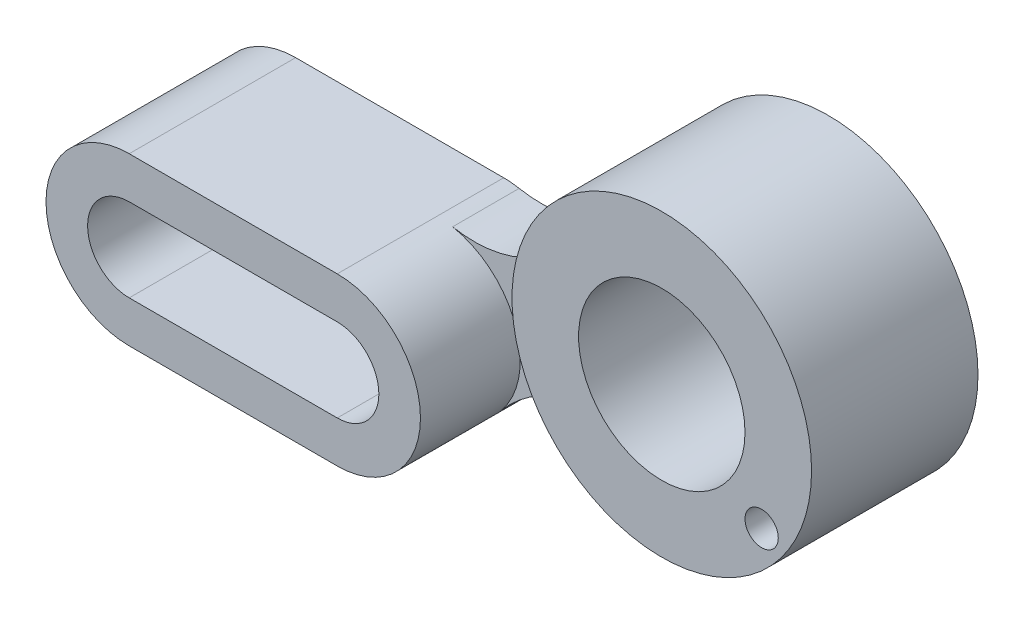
ISO-10303-21;
HEADER;
FILE_DESCRIPTION(('STEP AP214'),'2;1');
FILE_NAME('part.step','',(''),(''),'','','');
FILE_SCHEMA(('AUTOMOTIVE_DESIGN { 1 0 10303 214 1 1 1 1 }'));
ENDSEC;
DATA;
#1=APPLICATION_CONTEXT('core data for automotive mechanical design processes');
#2=APPLICATION_PROTOCOL_DEFINITION('international standard','automotive_design',2000,#1);
#3=PRODUCT_CONTEXT('',#1,'mechanical');
#4=PRODUCT('Part','Part','',(#3));
#5=PRODUCT_RELATED_PRODUCT_CATEGORY('part','',(#4));
#6=PRODUCT_DEFINITION_FORMATION('','',#4);
#7=PRODUCT_DEFINITION_CONTEXT('part definition',#1,'design');
#8=PRODUCT_DEFINITION('design','',#6,#7);
#9=PRODUCT_DEFINITION_SHAPE('','',#8);
#10=(LENGTH_UNIT() NAMED_UNIT(*) SI_UNIT(.MILLI.,.METRE.));
#11=(NAMED_UNIT(*) PLANE_ANGLE_UNIT() SI_UNIT($,.RADIAN.));
#12=(NAMED_UNIT(*) SI_UNIT($,.STERADIAN.) SOLID_ANGLE_UNIT());
#13=UNCERTAINTY_MEASURE_WITH_UNIT(LENGTH_MEASURE(1.E-05),#10,'distance_accuracy_value','');
#14=(GEOMETRIC_REPRESENTATION_CONTEXT(3) GLOBAL_UNCERTAINTY_ASSIGNED_CONTEXT((#13)) GLOBAL_UNIT_ASSIGNED_CONTEXT((#10,
#11,#12)) REPRESENTATION_CONTEXT('',''));
#15=CARTESIAN_POINT('',(0.,0.,0.));
#16=DIRECTION('',(0.,0.,1.));
#17=DIRECTION('',(1.,0.,0.));
#18=AXIS2_PLACEMENT_3D('',#15,#16,#17);
#19=CARTESIAN_POINT('',(0.,0.,80.));
#20=DIRECTION('',(0.,0.,1.));
#21=DIRECTION('',(1.,0.,0.));
#22=AXIS2_PLACEMENT_3D('',#19,#20,#21);
#23=PLANE('',#22);
#24=CARTESIAN_POINT('',(48.,-36.,80.));
#25=DIRECTION('',(0.,0.,1.));
#26=DIRECTION('',(1.,0.,0.));
#27=AXIS2_PLACEMENT_3D('',#24,#25,#26);
#28=CIRCLE('',#27,8.);
#29=CARTESIAN_POINT('',(56.,-36.,80.));
#30=VERTEX_POINT('',#29);
#31=EDGE_CURVE('E163',#30,#30,#28,.T.);
#32=ORIENTED_EDGE('',*,*,#31,.F.);
#33=EDGE_LOOP('',(#32));
#34=FACE_BOUND('',#33,.T.);
#35=CARTESIAN_POINT('',(0.,0.,80.));
#36=DIRECTION('',(0.,0.,1.));
#37=DIRECTION('',(1.,0.,0.));
#38=AXIS2_PLACEMENT_3D('',#35,#36,#37);
#39=CIRCLE('',#38,72.);
#40=CARTESIAN_POINT('',(72.,0.,80.));
#41=VERTEX_POINT('',#40);
#42=EDGE_CURVE('E11',#41,#41,#39,.T.);
#43=ORIENTED_EDGE('',*,*,#42,.T.);
#44=EDGE_LOOP('',(#43));
#45=FACE_BOUND('',#44,.T.);
#46=CARTESIAN_POINT('',(0.,0.,80.));
#47=DIRECTION('',(0.,0.,1.));
#48=DIRECTION('',(1.,0.,0.));
#49=AXIS2_PLACEMENT_3D('',#46,#47,#48);
#50=CIRCLE('',#49,40.);
#51=CARTESIAN_POINT('',(40.,0.,80.));
#52=VERTEX_POINT('',#51);
#53=EDGE_CURVE('E222',#52,#52,#50,.T.);
#54=ORIENTED_EDGE('',*,*,#53,.F.);
#55=EDGE_LOOP('',(#54));
#56=FACE_BOUND('',#55,.T.);
#57=ADVANCED_FACE('F31',(#34,#45,#56),#23,.T.);
#58=CARTESIAN_POINT('',(0.,0.,0.));
#59=DIRECTION('',(0.,0.,1.));
#60=DIRECTION('',(1.,0.,0.));
#61=AXIS2_PLACEMENT_3D('',#58,#59,#60);
#62=PLANE('',#61);
#63=CARTESIAN_POINT('',(48.,-36.,0.));
#64=DIRECTION('',(0.,0.,1.));
#65=DIRECTION('',(1.,0.,0.));
#66=AXIS2_PLACEMENT_3D('',#63,#64,#65);
#67=CIRCLE('',#66,8.);
#68=CARTESIAN_POINT('',(56.,-36.,0.));
#69=VERTEX_POINT('',#68);
#70=EDGE_CURVE('E261',#69,#69,#67,.T.);
#71=ORIENTED_EDGE('',*,*,#70,.T.);
#72=EDGE_LOOP('',(#71));
#73=FACE_BOUND('',#72,.T.);
#74=CARTESIAN_POINT('',(0.,0.,0.));
#75=DIRECTION('',(0.,0.,1.));
#76=DIRECTION('',(1.,0.,0.));
#77=AXIS2_PLACEMENT_3D('',#74,#75,#76);
#78=CIRCLE('',#77,72.);
#79=CARTESIAN_POINT('',(72.,0.,0.));
#80=VERTEX_POINT('',#79);
#81=EDGE_CURVE('E35',#80,#80,#78,.T.);
#82=ORIENTED_EDGE('',*,*,#81,.F.);
#83=EDGE_LOOP('',(#82));
#84=FACE_BOUND('',#83,.T.);
#85=CARTESIAN_POINT('',(0.,0.,0.));
#86=DIRECTION('',(0.,0.,1.));
#87=DIRECTION('',(1.,0.,0.));
#88=AXIS2_PLACEMENT_3D('',#85,#86,#87);
#89=CIRCLE('',#88,40.);
#90=CARTESIAN_POINT('',(40.,0.,0.));
#91=VERTEX_POINT('',#90);
#92=EDGE_CURVE('E221',#91,#91,#89,.T.);
#93=ORIENTED_EDGE('',*,*,#92,.T.);
#94=EDGE_LOOP('',(#93));
#95=FACE_BOUND('',#94,.T.);
#96=ADVANCED_FACE('F228',(#73,#84,#95),#62,.F.);
#97=CARTESIAN_POINT('',(0.,0.,80.));
#98=DIRECTION('',(0.,0.,-1.));
#99=DIRECTION('',(-1.,0.,0.));
#100=AXIS2_PLACEMENT_3D('',#97,#98,#99);
#101=CYLINDRICAL_SURFACE('',#100,72.);
#102=DIRECTION('',(0.,0.,-1.));
#103=VECTOR('',#102,1.);
#104=CARTESIAN_POINT('',(-68.6974248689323,21.5560621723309,48.));
#105=LINE('',#104,#103);
#106=CARTESIAN_POINT('',(-68.6974248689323,21.5560621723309,48.));
#107=VERTEX_POINT('',#106);
#108=CARTESIAN_POINT('',(-68.6974248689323,21.5560621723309,16.));
#109=VERTEX_POINT('',#108);
#110=EDGE_CURVE('E46',#107,#109,#105,.T.);
#111=ORIENTED_EDGE('',*,*,#110,.F.);
#112=CARTESIAN_POINT('',(0.,0.,48.));
#113=DIRECTION('',(0.,0.,1.));
#114=DIRECTION('',(1.,0.,0.));
#115=AXIS2_PLACEMENT_3D('',#112,#113,#114);
#116=CIRCLE('',#115,72.);
#117=CARTESIAN_POINT('',(-31.6388491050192,-64.6759864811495,48.));
#118=VERTEX_POINT('',#117);
#119=EDGE_CURVE('E50',#107,#118,#116,.T.);
#120=ORIENTED_EDGE('',*,*,#119,.T.);
#121=DIRECTION('',(0.,0.,-1.));
#122=VECTOR('',#121,1.);
#123=CARTESIAN_POINT('',(-31.6388491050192,-64.6759864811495,48.));
#124=LINE('',#123,#122);
#125=CARTESIAN_POINT('',(-31.6388491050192,-64.6759864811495,16.));
#126=VERTEX_POINT('',#125);
#127=EDGE_CURVE('E206',#118,#126,#124,.T.);
#128=ORIENTED_EDGE('',*,*,#127,.T.);
#129=CARTESIAN_POINT('',(0.,0.,16.));
#130=DIRECTION('',(0.,0.,1.));
#131=DIRECTION('',(1.,0.,0.));
#132=AXIS2_PLACEMENT_3D('',#129,#130,#131);
#133=CIRCLE('',#132,72.);
#134=EDGE_CURVE('E191',#109,#126,#133,.T.);
#135=ORIENTED_EDGE('',*,*,#134,.F.);
#136=EDGE_LOOP('',(#111,#120,#128,#135));
#137=FACE_BOUND('',#136,.T.);
#138=ORIENTED_EDGE('',*,*,#42,.F.);
#139=EDGE_LOOP('',(#138));
#140=FACE_BOUND('',#139,.T.);
#141=ORIENTED_EDGE('',*,*,#81,.T.);
#142=EDGE_LOOP('',(#141));
#143=FACE_BOUND('',#142,.T.);
#144=ADVANCED_FACE('F33',(#137,#140,#143),#101,.T.);
#145=CARTESIAN_POINT('',(0.,0.,80.));
#146=DIRECTION('',(0.,0.,-1.));
#147=DIRECTION('',(-1.,0.,0.));
#148=AXIS2_PLACEMENT_3D('',#145,#146,#147);
#149=CYLINDRICAL_SURFACE('',#148,40.);
#150=ORIENTED_EDGE('',*,*,#53,.T.);
#151=EDGE_LOOP('',(#150));
#152=FACE_BOUND('',#151,.T.);
#153=ORIENTED_EDGE('',*,*,#92,.F.);
#154=EDGE_LOOP('',(#153));
#155=FACE_BOUND('',#154,.T.);
#156=ADVANCED_FACE('F230',(#152,#155),#149,.F.);
#157=CARTESIAN_POINT('',(-122.128755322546,38.321888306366,48.));
#158=DIRECTION('',(0.,0.,-1.));
#159=DIRECTION('',(-1.,0.,0.));
#160=AXIS2_PLACEMENT_3D('',#157,#158,#159);
#161=CYLINDRICAL_SURFACE('',#160,56.);
#162=CARTESIAN_POINT('',(-122.128755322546,38.321888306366,16.));
#163=DIRECTION('',(0.,0.,1.));
#164=DIRECTION('',(1.,0.,0.));
#165=AXIS2_PLACEMENT_3D('',#162,#163,#164);
#166=CIRCLE('',#165,56.);
#167=CARTESIAN_POINT('',(-132.553648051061,-16.6992132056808,16.));
#168=VERTEX_POINT('',#167);
#169=EDGE_CURVE('E209',#168,#109,#166,.T.);
#170=ORIENTED_EDGE('',*,*,#169,.F.);
#171=DIRECTION('',(0.,0.,-1.));
#172=VECTOR('',#171,1.);
#173=CARTESIAN_POINT('',(-132.553648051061,-16.6992132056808,48.));
#174=LINE('',#173,#172);
#175=CARTESIAN_POINT('',(-132.553648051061,-16.6992132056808,48.));
#176=VERTEX_POINT('',#175);
#177=EDGE_CURVE('E217',#176,#168,#174,.T.);
#178=ORIENTED_EDGE('',*,*,#177,.F.);
#179=CARTESIAN_POINT('',(-122.128755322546,38.321888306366,48.));
#180=DIRECTION('',(0.,0.,1.));
#181=DIRECTION('',(1.,0.,0.));
#182=AXIS2_PLACEMENT_3D('',#179,#180,#181);
#183=CIRCLE('',#182,56.);
#184=EDGE_CURVE('E197',#176,#107,#183,.T.);
#185=ORIENTED_EDGE('',*,*,#184,.T.);
#186=ORIENTED_EDGE('',*,*,#110,.T.);
#187=EDGE_LOOP('',(#170,#178,#185,#186));
#188=FACE_BOUND('',#187,.T.);
#189=ADVANCED_FACE('F232',(#188),#161,.F.);
#190=CARTESIAN_POINT('',(-59.762270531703,-122.165752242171,48.));
#191=DIRECTION('',(0.,0.,-1.));
#192=DIRECTION('',(-1.,0.,0.));
#193=AXIS2_PLACEMENT_3D('',#190,#191,#192);
#194=CYLINDRICAL_SURFACE('',#193,64.);
#195=CARTESIAN_POINT('',(-59.762270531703,-122.165752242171,16.));
#196=DIRECTION('',(0.,0.,1.));
#197=DIRECTION('',(1.,0.,0.));
#198=AXIS2_PLACEMENT_3D('',#195,#196,#197);
#199=CIRCLE('',#198,64.);
#200=CARTESIAN_POINT('',(-109.139334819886,-81.4483662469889,16.));
#201=VERTEX_POINT('',#200);
#202=EDGE_CURVE('E198',#126,#201,#199,.T.);
#203=ORIENTED_EDGE('',*,*,#202,.F.);
#204=ORIENTED_EDGE('',*,*,#127,.F.);
#205=CARTESIAN_POINT('',(-59.762270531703,-122.165752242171,48.));
#206=DIRECTION('',(0.,0.,1.));
#207=DIRECTION('',(1.,0.,0.));
#208=AXIS2_PLACEMENT_3D('',#205,#206,#207);
#209=CIRCLE('',#208,64.);
#210=CARTESIAN_POINT('',(-109.139334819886,-81.4483662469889,48.));
#211=VERTEX_POINT('',#210);
#212=EDGE_CURVE('E203',#118,#211,#209,.T.);
#213=ORIENTED_EDGE('',*,*,#212,.T.);
#214=DIRECTION('',(0.,0.,-1.));
#215=VECTOR('',#214,1.);
#216=CARTESIAN_POINT('',(-109.139334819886,-81.4483662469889,48.));
#217=LINE('',#216,#215);
#218=EDGE_CURVE('E214',#211,#201,#217,.T.);
#219=ORIENTED_EDGE('',*,*,#218,.T.);
#220=EDGE_LOOP('',(#203,#204,#213,#219));
#221=FACE_BOUND('',#220,.T.);
#222=ADVANCED_FACE('F239',(#221),#194,.F.);
#223=CARTESIAN_POINT('',(-147.271000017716,-270.263028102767,48.));
#224=DIRECTION('',(0.,0.,1.));
#225=DIRECTION('',(1.,0.,0.));
#226=AXIS2_PLACEMENT_3D('',#223,#224,#225);
#227=PLANE('',#226);
#228=ORIENTED_EDGE('',*,*,#119,.F.);
#229=ORIENTED_EDGE('',*,*,#184,.F.);
#230=CARTESIAN_POINT('',(-140.,-56.,48.));
#231=DIRECTION('',(0.,0.,1.));
#232=DIRECTION('',(1.,0.,0.));
#233=AXIS2_PLACEMENT_3D('',#230,#231,#232);
#234=CIRCLE('',#233,40.);
#235=EDGE_CURVE('E201',#176,#211,#234,.F.);
#236=ORIENTED_EDGE('',*,*,#235,.T.);
#237=ORIENTED_EDGE('',*,*,#212,.F.);
#238=EDGE_LOOP('',(#228,#229,#236,#237));
#239=FACE_BOUND('',#238,.T.);
#240=ADVANCED_FACE('F303',(#239),#227,.T.);
#241=CARTESIAN_POINT('',(-147.271000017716,-270.263028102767,16.));
#242=DIRECTION('',(0.,0.,1.));
#243=DIRECTION('',(1.,0.,0.));
#244=AXIS2_PLACEMENT_3D('',#241,#242,#243);
#245=PLANE('',#244);
#246=ORIENTED_EDGE('',*,*,#134,.T.);
#247=ORIENTED_EDGE('',*,*,#202,.T.);
#248=CARTESIAN_POINT('',(-140.,-56.,16.));
#249=DIRECTION('',(0.,0.,1.));
#250=DIRECTION('',(1.,0.,0.));
#251=AXIS2_PLACEMENT_3D('',#248,#249,#250);
#252=CIRCLE('',#251,40.);
#253=CARTESIAN_POINT('',(-140.,-96.,16.));
#254=VERTEX_POINT('',#253);
#255=EDGE_CURVE('E165',#201,#254,#252,.F.);
#256=ORIENTED_EDGE('',*,*,#255,.T.);
#257=DIRECTION('',(-1.,0.,0.));
#258=VECTOR('',#257,1.);
#259=CARTESIAN_POINT('',(-147.271000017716,-96.,16.));
#260=LINE('',#259,#258);
#261=CARTESIAN_POINT('',(-240.,-96.,16.));
#262=VERTEX_POINT('',#261);
#263=EDGE_CURVE('E162',#254,#262,#260,.T.);
#264=ORIENTED_EDGE('',*,*,#263,.T.);
#265=CARTESIAN_POINT('',(-240.,-56.,16.));
#266=DIRECTION('',(0.,0.,1.));
#267=DIRECTION('',(1.,0.,0.));
#268=AXIS2_PLACEMENT_3D('',#265,#266,#267);
#269=CIRCLE('',#268,40.);
#270=CARTESIAN_POINT('',(-240.,-16.,16.));
#271=VERTEX_POINT('',#270);
#272=EDGE_CURVE('E124',#262,#271,#269,.F.);
#273=ORIENTED_EDGE('',*,*,#272,.T.);
#274=DIRECTION('',(1.,0.,0.));
#275=VECTOR('',#274,1.);
#276=CARTESIAN_POINT('',(-147.271000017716,-16.,16.));
#277=LINE('',#276,#275);
#278=CARTESIAN_POINT('',(-140.,-16.,16.));
#279=VERTEX_POINT('',#278);
#280=EDGE_CURVE('E169',#271,#279,#277,.T.);
#281=ORIENTED_EDGE('',*,*,#280,.T.);
#282=EDGE_CURVE('E166',#279,#168,#252,.F.);
#283=ORIENTED_EDGE('',*,*,#282,.T.);
#284=ORIENTED_EDGE('',*,*,#169,.T.);
#285=EDGE_LOOP('',(#246,#247,#256,#264,#273,#281,#283,#284));
#286=FACE_BOUND('',#285,.T.);
#287=DIRECTION('',(-1.,0.,0.));
#288=VECTOR('',#287,1.);
#289=CARTESIAN_POINT('',(-147.271000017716,-76.,16.));
#290=LINE('',#289,#288);
#291=CARTESIAN_POINT('',(-140.,-76.,16.));
#292=VERTEX_POINT('',#291);
#293=CARTESIAN_POINT('',(-240.,-76.,16.));
#294=VERTEX_POINT('',#293);
#295=EDGE_CURVE('E172',#292,#294,#290,.T.);
#296=ORIENTED_EDGE('',*,*,#295,.F.);
#297=CARTESIAN_POINT('',(-140.,-56.,16.));
#298=DIRECTION('',(0.,0.,1.));
#299=DIRECTION('',(1.,0.,0.));
#300=AXIS2_PLACEMENT_3D('',#297,#298,#299);
#301=CIRCLE('',#300,20.);
#302=CARTESIAN_POINT('',(-140.,-36.,16.));
#303=VERTEX_POINT('',#302);
#304=EDGE_CURVE('E141',#303,#292,#301,.F.);
#305=ORIENTED_EDGE('',*,*,#304,.F.);
#306=DIRECTION('',(1.,0.,0.));
#307=VECTOR('',#306,1.);
#308=CARTESIAN_POINT('',(-147.271000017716,-36.,16.));
#309=LINE('',#308,#307);
#310=CARTESIAN_POINT('',(-240.,-36.,16.));
#311=VERTEX_POINT('',#310);
#312=EDGE_CURVE('E177',#311,#303,#309,.T.);
#313=ORIENTED_EDGE('',*,*,#312,.F.);
#314=CARTESIAN_POINT('',(-240.,-56.,16.));
#315=DIRECTION('',(0.,0.,1.));
#316=DIRECTION('',(1.,0.,0.));
#317=AXIS2_PLACEMENT_3D('',#314,#315,#316);
#318=CIRCLE('',#317,20.);
#319=EDGE_CURVE('E175',#294,#311,#318,.F.);
#320=ORIENTED_EDGE('',*,*,#319,.F.);
#321=EDGE_LOOP('',(#296,#305,#313,#320));
#322=FACE_BOUND('',#321,.T.);
#323=ADVANCED_FACE('F290',(#286,#322),#245,.F.);
#324=CARTESIAN_POINT('',(-147.271000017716,-76.,96.));
#325=DIRECTION('',(0.,-1.,0.));
#326=DIRECTION('',(1.,0.,0.));
#327=AXIS2_PLACEMENT_3D('',#324,#325,#326);
#328=PLANE('',#327);
#329=ORIENTED_EDGE('',*,*,#295,.T.);
#330=DIRECTION('',(0.,0.,-1.));
#331=VECTOR('',#330,1.);
#332=CARTESIAN_POINT('',(-240.,-76.,96.));
#333=LINE('',#332,#331);
#334=CARTESIAN_POINT('',(-240.,-76.,96.));
#335=VERTEX_POINT('',#334);
#336=EDGE_CURVE('E188',#335,#294,#333,.T.);
#337=ORIENTED_EDGE('',*,*,#336,.F.);
#338=DIRECTION('',(-1.,0.,0.));
#339=VECTOR('',#338,1.);
#340=CARTESIAN_POINT('',(-147.271000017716,-76.,96.));
#341=LINE('',#340,#339);
#342=CARTESIAN_POINT('',(-140.,-76.,96.));
#343=VERTEX_POINT('',#342);
#344=EDGE_CURVE('E151',#343,#335,#341,.T.);
#345=ORIENTED_EDGE('',*,*,#344,.F.);
#346=DIRECTION('',(0.,0.,-1.));
#347=VECTOR('',#346,1.);
#348=CARTESIAN_POINT('',(-140.,-76.,96.));
#349=LINE('',#348,#347);
#350=EDGE_CURVE('E129',#343,#292,#349,.T.);
#351=ORIENTED_EDGE('',*,*,#350,.T.);
#352=EDGE_LOOP('',(#329,#337,#345,#351));
#353=FACE_BOUND('',#352,.T.);
#354=ADVANCED_FACE('F286',(#353),#328,.F.);
#355=CARTESIAN_POINT('',(-240.,-56.,96.));
#356=DIRECTION('',(0.,0.,-1.));
#357=DIRECTION('',(-1.,0.,0.));
#358=AXIS2_PLACEMENT_3D('',#355,#356,#357);
#359=CYLINDRICAL_SURFACE('',#358,20.);
#360=ORIENTED_EDGE('',*,*,#319,.T.);
#361=DIRECTION('',(0.,0.,-1.));
#362=VECTOR('',#361,1.);
#363=CARTESIAN_POINT('',(-240.,-36.,96.));
#364=LINE('',#363,#362);
#365=CARTESIAN_POINT('',(-240.,-36.,96.));
#366=VERTEX_POINT('',#365);
#367=EDGE_CURVE('E185',#366,#311,#364,.T.);
#368=ORIENTED_EDGE('',*,*,#367,.F.);
#369=CARTESIAN_POINT('',(-240.,-56.,96.));
#370=DIRECTION('',(0.,0.,1.));
#371=DIRECTION('',(1.,0.,0.));
#372=AXIS2_PLACEMENT_3D('',#369,#370,#371);
#373=CIRCLE('',#372,20.);
#374=EDGE_CURVE('E154',#335,#366,#373,.F.);
#375=ORIENTED_EDGE('',*,*,#374,.F.);
#376=ORIENTED_EDGE('',*,*,#336,.T.);
#377=EDGE_LOOP('',(#360,#368,#375,#376));
#378=FACE_BOUND('',#377,.T.);
#379=ADVANCED_FACE('F282',(#378),#359,.F.);
#380=CARTESIAN_POINT('',(-147.271000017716,-36.,96.));
#381=DIRECTION('',(0.,1.,0.));
#382=DIRECTION('',(-1.,0.,0.));
#383=AXIS2_PLACEMENT_3D('',#380,#381,#382);
#384=PLANE('',#383);
#385=ORIENTED_EDGE('',*,*,#312,.T.);
#386=DIRECTION('',(0.,0.,-1.));
#387=VECTOR('',#386,1.);
#388=CARTESIAN_POINT('',(-140.,-36.,96.));
#389=LINE('',#388,#387);
#390=CARTESIAN_POINT('',(-140.,-36.,96.));
#391=VERTEX_POINT('',#390);
#392=EDGE_CURVE('E182',#391,#303,#389,.T.);
#393=ORIENTED_EDGE('',*,*,#392,.F.);
#394=DIRECTION('',(1.,0.,0.));
#395=VECTOR('',#394,1.);
#396=CARTESIAN_POINT('',(-147.271000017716,-36.,96.));
#397=LINE('',#396,#395);
#398=EDGE_CURVE('E156',#366,#391,#397,.T.);
#399=ORIENTED_EDGE('',*,*,#398,.F.);
#400=ORIENTED_EDGE('',*,*,#367,.T.);
#401=EDGE_LOOP('',(#385,#393,#399,#400));
#402=FACE_BOUND('',#401,.T.);
#403=ADVANCED_FACE('F279',(#402),#384,.F.);
#404=CARTESIAN_POINT('',(-240.,-56.,96.));
#405=DIRECTION('',(0.,0.,-1.));
#406=DIRECTION('',(-1.,0.,0.));
#407=AXIS2_PLACEMENT_3D('',#404,#405,#406);
#408=CYLINDRICAL_SURFACE('',#407,40.);
#409=ORIENTED_EDGE('',*,*,#272,.F.);
#410=DIRECTION('',(0.,0.,-1.));
#411=VECTOR('',#410,1.);
#412=CARTESIAN_POINT('',(-240.,-96.,96.));
#413=LINE('',#412,#411);
#414=CARTESIAN_POINT('',(-240.,-96.,96.));
#415=VERTEX_POINT('',#414);
#416=EDGE_CURVE('E118',#415,#262,#413,.T.);
#417=ORIENTED_EDGE('',*,*,#416,.F.);
#418=CARTESIAN_POINT('',(-240.,-56.,96.));
#419=DIRECTION('',(0.,0.,1.));
#420=DIRECTION('',(1.,0.,0.));
#421=AXIS2_PLACEMENT_3D('',#418,#419,#420);
#422=CIRCLE('',#421,40.);
#423=CARTESIAN_POINT('',(-240.,-16.,96.));
#424=VERTEX_POINT('',#423);
#425=EDGE_CURVE('E121',#415,#424,#422,.F.);
#426=ORIENTED_EDGE('',*,*,#425,.T.);
#427=DIRECTION('',(0.,0.,-1.));
#428=VECTOR('',#427,1.);
#429=CARTESIAN_POINT('',(-240.,-16.,96.));
#430=LINE('',#429,#428);
#431=EDGE_CURVE('E160',#424,#271,#430,.T.);
#432=ORIENTED_EDGE('',*,*,#431,.T.);
#433=EDGE_LOOP('',(#409,#417,#426,#432));
#434=FACE_BOUND('',#433,.T.);
#435=ADVANCED_FACE('F120',(#434),#408,.T.);
#436=CARTESIAN_POINT('',(-147.271000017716,-96.,96.));
#437=DIRECTION('',(0.,-1.,0.));
#438=DIRECTION('',(1.,0.,0.));
#439=AXIS2_PLACEMENT_3D('',#436,#437,#438);
#440=PLANE('',#439);
#441=ORIENTED_EDGE('',*,*,#263,.F.);
#442=DIRECTION('',(0.,0.,-1.));
#443=VECTOR('',#442,1.);
#444=CARTESIAN_POINT('',(-140.,-96.,96.));
#445=LINE('',#444,#443);
#446=CARTESIAN_POINT('',(-140.,-96.,96.));
#447=VERTEX_POINT('',#446);
#448=EDGE_CURVE('E130',#447,#254,#445,.T.);
#449=ORIENTED_EDGE('',*,*,#448,.F.);
#450=DIRECTION('',(-1.,0.,0.));
#451=VECTOR('',#450,1.);
#452=CARTESIAN_POINT('',(-147.271000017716,-96.,96.));
#453=LINE('',#452,#451);
#454=EDGE_CURVE('E137',#447,#415,#453,.T.);
#455=ORIENTED_EDGE('',*,*,#454,.T.);
#456=ORIENTED_EDGE('',*,*,#416,.T.);
#457=EDGE_LOOP('',(#441,#449,#455,#456));
#458=FACE_BOUND('',#457,.T.);
#459=ADVANCED_FACE('F143',(#458),#440,.T.);
#460=CARTESIAN_POINT('',(-140.,-56.,96.));
#461=DIRECTION('',(0.,0.,-1.));
#462=DIRECTION('',(-1.,0.,0.));
#463=AXIS2_PLACEMENT_3D('',#460,#461,#462);
#464=CYLINDRICAL_SURFACE('',#463,40.);
#465=ORIENTED_EDGE('',*,*,#235,.F.);
#466=ORIENTED_EDGE('',*,*,#177,.T.);
#467=ORIENTED_EDGE('',*,*,#282,.F.);
#468=DIRECTION('',(0.,0.,-1.));
#469=VECTOR('',#468,1.);
#470=CARTESIAN_POINT('',(-140.,-16.,96.));
#471=LINE('',#470,#469);
#472=CARTESIAN_POINT('',(-140.,-16.,96.));
#473=VERTEX_POINT('',#472);
#474=EDGE_CURVE('E193',#473,#279,#471,.T.);
#475=ORIENTED_EDGE('',*,*,#474,.F.);
#476=CARTESIAN_POINT('',(-140.,-56.,96.));
#477=DIRECTION('',(0.,0.,1.));
#478=DIRECTION('',(1.,0.,0.));
#479=AXIS2_PLACEMENT_3D('',#476,#477,#478);
#480=CIRCLE('',#479,40.);
#481=EDGE_CURVE('E145',#473,#447,#480,.F.);
#482=ORIENTED_EDGE('',*,*,#481,.T.);
#483=ORIENTED_EDGE('',*,*,#448,.T.);
#484=ORIENTED_EDGE('',*,*,#255,.F.);
#485=ORIENTED_EDGE('',*,*,#218,.F.);
#486=EDGE_LOOP('',(#465,#466,#467,#475,#482,#483,#484,#485));
#487=FACE_BOUND('',#486,.T.);
#488=ADVANCED_FACE('F294',(#487),#464,.T.);
#489=CARTESIAN_POINT('',(-147.271000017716,-16.,96.));
#490=DIRECTION('',(0.,1.,0.));
#491=DIRECTION('',(-1.,0.,0.));
#492=AXIS2_PLACEMENT_3D('',#489,#490,#491);
#493=PLANE('',#492);
#494=ORIENTED_EDGE('',*,*,#280,.F.);
#495=ORIENTED_EDGE('',*,*,#431,.F.);
#496=DIRECTION('',(1.,0.,0.));
#497=VECTOR('',#496,1.);
#498=CARTESIAN_POINT('',(-147.271000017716,-16.,96.));
#499=LINE('',#498,#497);
#500=EDGE_CURVE('E140',#424,#473,#499,.T.);
#501=ORIENTED_EDGE('',*,*,#500,.T.);
#502=ORIENTED_EDGE('',*,*,#474,.T.);
#503=EDGE_LOOP('',(#494,#495,#501,#502));
#504=FACE_BOUND('',#503,.T.);
#505=ADVANCED_FACE('F277',(#504),#493,.T.);
#506=CARTESIAN_POINT('',(-140.,-56.,96.));
#507=DIRECTION('',(0.,0.,-1.));
#508=DIRECTION('',(-1.,0.,0.));
#509=AXIS2_PLACEMENT_3D('',#506,#507,#508);
#510=CYLINDRICAL_SURFACE('',#509,20.);
#511=ORIENTED_EDGE('',*,*,#304,.T.);
#512=ORIENTED_EDGE('',*,*,#350,.F.);
#513=CARTESIAN_POINT('',(-140.,-56.,96.));
#514=DIRECTION('',(0.,0.,1.));
#515=DIRECTION('',(1.,0.,0.));
#516=AXIS2_PLACEMENT_3D('',#513,#514,#515);
#517=CIRCLE('',#516,20.);
#518=EDGE_CURVE('E158',#391,#343,#517,.F.);
#519=ORIENTED_EDGE('',*,*,#518,.F.);
#520=ORIENTED_EDGE('',*,*,#392,.T.);
#521=EDGE_LOOP('',(#511,#512,#519,#520));
#522=FACE_BOUND('',#521,.T.);
#523=ADVANCED_FACE('F272',(#522),#510,.F.);
#524=CARTESIAN_POINT('',(-147.271000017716,-270.263028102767,96.));
#525=DIRECTION('',(0.,0.,1.));
#526=DIRECTION('',(1.,0.,0.));
#527=AXIS2_PLACEMENT_3D('',#524,#525,#526);
#528=PLANE('',#527);
#529=ORIENTED_EDGE('',*,*,#425,.F.);
#530=ORIENTED_EDGE('',*,*,#454,.F.);
#531=ORIENTED_EDGE('',*,*,#481,.F.);
#532=ORIENTED_EDGE('',*,*,#500,.F.);
#533=EDGE_LOOP('',(#529,#530,#531,#532));
#534=FACE_BOUND('',#533,.T.);
#535=ORIENTED_EDGE('',*,*,#344,.T.);
#536=ORIENTED_EDGE('',*,*,#374,.T.);
#537=ORIENTED_EDGE('',*,*,#398,.T.);
#538=ORIENTED_EDGE('',*,*,#518,.T.);
#539=EDGE_LOOP('',(#535,#536,#537,#538));
#540=FACE_BOUND('',#539,.T.);
#541=ADVANCED_FACE('F134',(#534,#540),#528,.T.);
#542=CARTESIAN_POINT('',(48.,-36.,0.));
#543=DIRECTION('',(0.,0.,1.));
#544=DIRECTION('',(1.,0.,0.));
#545=AXIS2_PLACEMENT_3D('',#542,#543,#544);
#546=CYLINDRICAL_SURFACE('',#545,8.);
#547=ORIENTED_EDGE('',*,*,#31,.T.);
#548=EDGE_LOOP('',(#547));
#549=FACE_BOUND('',#548,.T.);
#550=ORIENTED_EDGE('',*,*,#70,.F.);
#551=EDGE_LOOP('',(#550));
#552=FACE_BOUND('',#551,.T.);
#553=ADVANCED_FACE('F266',(#549,#552),#546,.F.);
#554=CLOSED_SHELL('',(#57,#96,#144,#156,#189,#222,#240,#323,#354,#379,#403,#435,#459,#488,#505,
#523,#541,#553));
#555=MANIFOLD_SOLID_BREP('B2',#554);
#556=ADVANCED_BREP_SHAPE_REPRESENTATION('',(#18,#555),#14);
#557=SHAPE_DEFINITION_REPRESENTATION(#9,#556);
ENDSEC;
END-ISO-10303-21;
